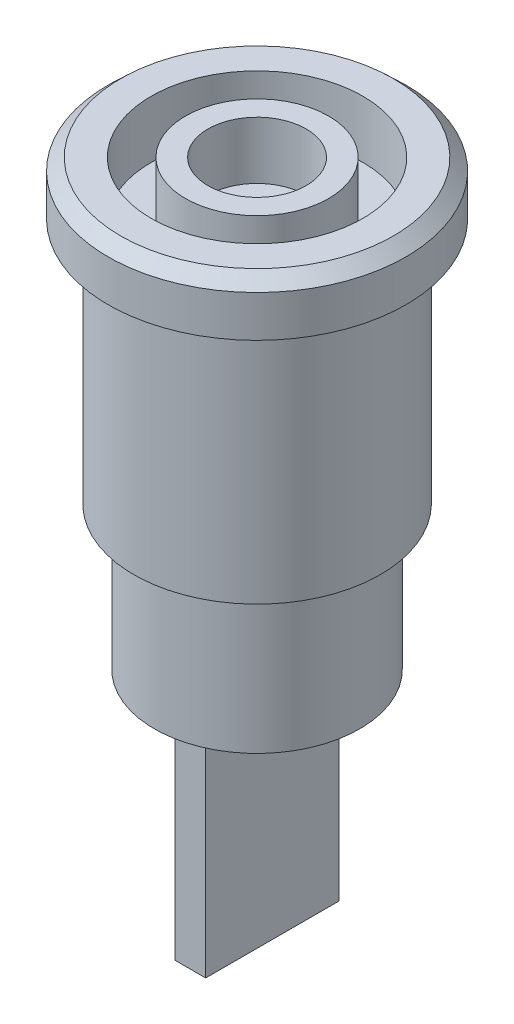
from build123d import *

# Parameters (mm, degrees)
ESQUISSE2_W      = 1.5
ESQUISSE2_H      = 6.5
EXTRUSION1_DEPTH = 11


with BuildPart() as part:
    # Esquisse1 → R_volution1 (revolve)
    with BuildSketch(Plane.XY, mode=Mode.PRIVATE) as r_volution1_sk:
        Polygon((0, 0), (5, 0), (5, 7), (6, 7), (6, 19), (7.246535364, 19), (7.246535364, 21.017279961), (6.636192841, 21.593816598), (5.153738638, 21.593816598), (5.153738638, 18.8017697), (3.48178239, 18.8017697), (3.48178239, 21.593816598), (2.391682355, 21.593816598), (2.391682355, 18.8017697), (0, 18.8017697), align=None)
    revolve(r_volution1_sk.sketch.rotate(Axis((0, 0, 0), (0, 1, 0)), 90), axis=Axis((0, 0, 0), (0, 1, 0)))

    # Esquisse2 → Extrusion1 (add)
    with BuildSketch(Plane.XZ):
        Rectangle(ESQUISSE2_W, ESQUISSE2_H)
    extrude(amount=EXTRUSION1_DEPTH)


solid = part.part
